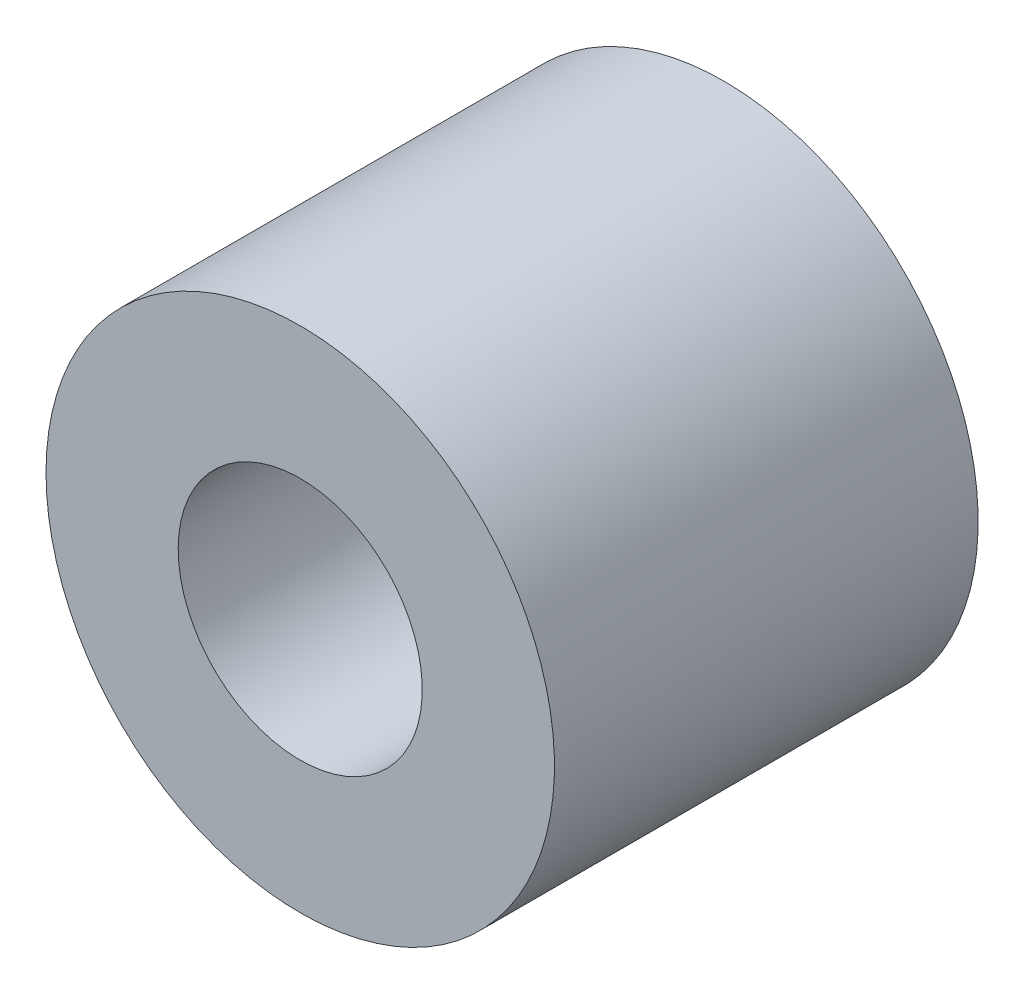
from build123d import *

# Parameters (mm, degrees)
SKETCH1_R          = 2.38125
EXTRUDE1_DEPTH     = 3.96875
SKETCH2_R          = 1.143
CUT_EXTRUDE1_DEPTH = 6.204966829


with BuildPart() as part:
    # Sketch1 → Extrude1 (new body)
    with BuildSketch(Plane(origin=(0, 0, 0), x_dir=(-1, 0, 0), z_dir=(0, 0, -1))):
        Circle(SKETCH1_R)
    extrude(amount=EXTRUDE1_DEPTH)

    # Sketch2 → Cut-Extrude1 (cut, through all)
    with BuildSketch(Plane(origin=(0, 0, -3.96875), x_dir=(-1, 0, 0), z_dir=(0, 0, -1))):
        Circle(SKETCH2_R)
    extrude(amount=-CUT_EXTRUDE1_DEPTH, mode=Mode.SUBTRACT)


solid = part.part
